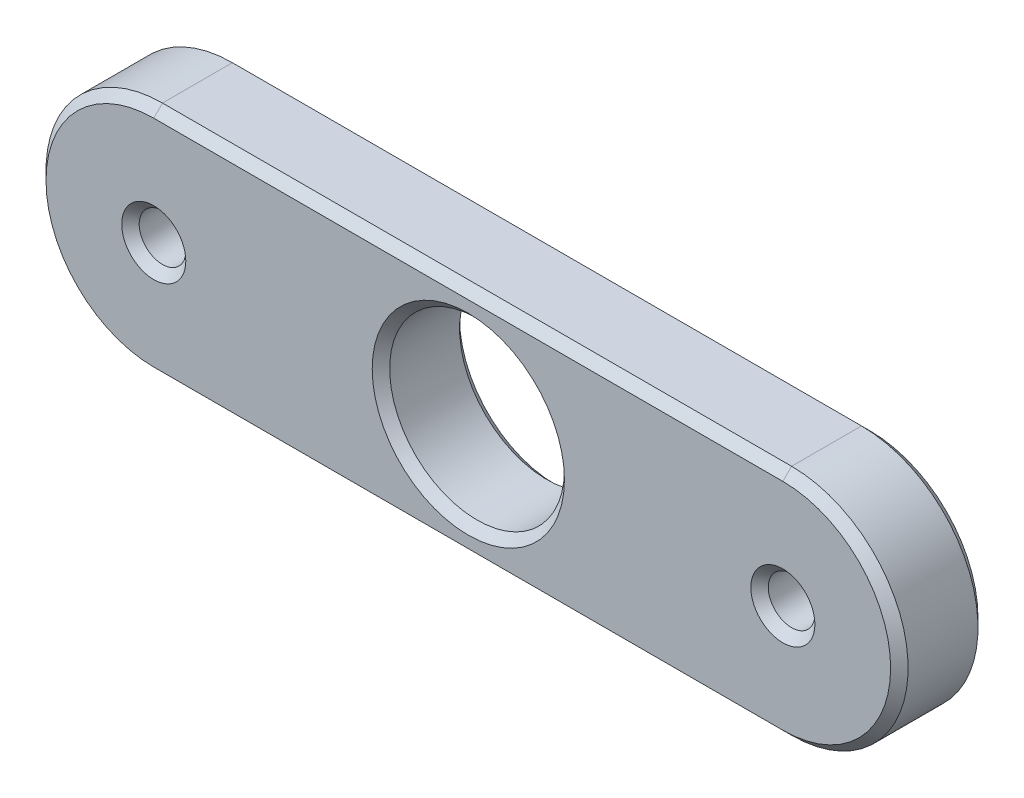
ISO-10303-21;
HEADER;
FILE_DESCRIPTION(('STEP AP214'),'2;1');
FILE_NAME('part.step','',(''),(''),'','','');
FILE_SCHEMA(('AUTOMOTIVE_DESIGN { 1 0 10303 214 1 1 1 1 }'));
ENDSEC;
DATA;
#1=APPLICATION_CONTEXT('core data for automotive mechanical design processes');
#2=APPLICATION_PROTOCOL_DEFINITION('international standard','automotive_design',2000,#1);
#3=PRODUCT_CONTEXT('',#1,'mechanical');
#4=PRODUCT('Part','Part','',(#3));
#5=PRODUCT_RELATED_PRODUCT_CATEGORY('part','',(#4));
#6=PRODUCT_DEFINITION_FORMATION('','',#4);
#7=PRODUCT_DEFINITION_CONTEXT('part definition',#1,'design');
#8=PRODUCT_DEFINITION('design','',#6,#7);
#9=PRODUCT_DEFINITION_SHAPE('','',#8);
#10=(LENGTH_UNIT() NAMED_UNIT(*) SI_UNIT(.MILLI.,.METRE.));
#11=(NAMED_UNIT(*) PLANE_ANGLE_UNIT() SI_UNIT($,.RADIAN.));
#12=(NAMED_UNIT(*) SI_UNIT($,.STERADIAN.) SOLID_ANGLE_UNIT());
#13=UNCERTAINTY_MEASURE_WITH_UNIT(LENGTH_MEASURE(1.E-05),#10,'distance_accuracy_value','');
#14=(GEOMETRIC_REPRESENTATION_CONTEXT(3) GLOBAL_UNCERTAINTY_ASSIGNED_CONTEXT((#13)) GLOBAL_UNIT_ASSIGNED_CONTEXT((#10,
#11,#12)) REPRESENTATION_CONTEXT('',''));
#15=CARTESIAN_POINT('',(0.,0.,0.));
#16=DIRECTION('',(0.,0.,1.));
#17=DIRECTION('',(1.,0.,0.));
#18=AXIS2_PLACEMENT_3D('',#15,#16,#17);
#19=CARTESIAN_POINT('',(27.,0.,7.5));
#20=DIRECTION('',(0.,0.,1.));
#21=DIRECTION('',(1.,0.,0.));
#22=AXIS2_PLACEMENT_3D('',#19,#20,#21);
#23=PLANE('',#22);
#24=CARTESIAN_POINT('',(0.,0.,7.5));
#25=DIRECTION('',(0.,0.,1.));
#26=DIRECTION('',(1.,0.,0.));
#27=AXIS2_PLACEMENT_3D('',#24,#25,#26);
#28=CIRCLE('',#27,8.24999999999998);
#29=CARTESIAN_POINT('',(8.24999999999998,0.,7.5));
#30=VERTEX_POINT('',#29);
#31=EDGE_CURVE('E11',#30,#30,#28,.F.);
#32=ORIENTED_EDGE('',*,*,#31,.T.);
#33=EDGE_LOOP('',(#32));
#34=FACE_BOUND('',#33,.T.);
#35=CARTESIAN_POINT('',(-27.,0.,7.5));
#36=DIRECTION('',(0.,0.,1.));
#37=DIRECTION('',(1.,0.,0.));
#38=AXIS2_PLACEMENT_3D('',#35,#36,#37);
#39=CIRCLE('',#38,2.75000000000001);
#40=CARTESIAN_POINT('',(-24.25,0.,7.5));
#41=VERTEX_POINT('',#40);
#42=EDGE_CURVE('E42',#41,#41,#39,.F.);
#43=ORIENTED_EDGE('',*,*,#42,.T.);
#44=EDGE_LOOP('',(#43));
#45=FACE_BOUND('',#44,.T.);
#46=CARTESIAN_POINT('',(-27.,0.,7.5));
#47=DIRECTION('',(0.,0.,1.));
#48=DIRECTION('',(1.,0.,0.));
#49=AXIS2_PLACEMENT_3D('',#46,#47,#48);
#50=CIRCLE('',#49,9.25000000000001);
#51=CARTESIAN_POINT('',(-27.,9.25,7.5));
#52=VERTEX_POINT('',#51);
#53=CARTESIAN_POINT('',(-27.,-9.25000000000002,7.5));
#54=VERTEX_POINT('',#53);
#55=EDGE_CURVE('E50',#52,#54,#50,.T.);
#56=ORIENTED_EDGE('',*,*,#55,.T.);
#57=DIRECTION('',(1.,0.,0.));
#58=VECTOR('',#57,1.);
#59=CARTESIAN_POINT('',(27.,-9.25,7.5));
#60=LINE('',#59,#58);
#61=CARTESIAN_POINT('',(27.,-9.25,7.5));
#62=VERTEX_POINT('',#61);
#63=EDGE_CURVE('E181',#54,#62,#60,.T.);
#64=ORIENTED_EDGE('',*,*,#63,.T.);
#65=CARTESIAN_POINT('',(27.,0.,7.5));
#66=DIRECTION('',(0.,0.,1.));
#67=DIRECTION('',(1.,0.,0.));
#68=AXIS2_PLACEMENT_3D('',#65,#66,#67);
#69=CIRCLE('',#68,9.25000000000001);
#70=CARTESIAN_POINT('',(27.,9.25000000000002,7.5));
#71=VERTEX_POINT('',#70);
#72=EDGE_CURVE('E177',#62,#71,#69,.T.);
#73=ORIENTED_EDGE('',*,*,#72,.T.);
#74=DIRECTION('',(-1.,0.,0.));
#75=VECTOR('',#74,1.);
#76=CARTESIAN_POINT('',(-27.,9.25,7.5));
#77=LINE('',#76,#75);
#78=EDGE_CURVE('E55',#71,#52,#77,.T.);
#79=ORIENTED_EDGE('',*,*,#78,.T.);
#80=EDGE_LOOP('',(#56,#64,#73,#79));
#81=FACE_BOUND('',#80,.T.);
#82=CARTESIAN_POINT('',(27.,0.,7.5));
#83=DIRECTION('',(0.,0.,1.));
#84=DIRECTION('',(1.,0.,0.));
#85=AXIS2_PLACEMENT_3D('',#82,#83,#84);
#86=CIRCLE('',#85,2.74999999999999);
#87=CARTESIAN_POINT('',(29.75,0.,7.5));
#88=VERTEX_POINT('',#87);
#89=EDGE_CURVE('E174',#88,#88,#86,.F.);
#90=ORIENTED_EDGE('',*,*,#89,.T.);
#91=EDGE_LOOP('',(#90));
#92=FACE_BOUND('',#91,.T.);
#93=ADVANCED_FACE('F33',(#34,#45,#81,#92),#23,.T.);
#94=CARTESIAN_POINT('',(27.,0.,0.));
#95=DIRECTION('',(0.,0.,1.));
#96=DIRECTION('',(1.,0.,0.));
#97=AXIS2_PLACEMENT_3D('',#94,#95,#96);
#98=PLANE('',#97);
#99=CARTESIAN_POINT('',(0.,0.,0.));
#100=DIRECTION('',(0.,0.,1.));
#101=DIRECTION('',(1.,0.,0.));
#102=AXIS2_PLACEMENT_3D('',#99,#100,#101);
#103=CIRCLE('',#102,8.24999999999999);
#104=CARTESIAN_POINT('',(8.24999999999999,0.,0.));
#105=VERTEX_POINT('',#104);
#106=EDGE_CURVE('E137',#105,#105,#103,.T.);
#107=ORIENTED_EDGE('',*,*,#106,.T.);
#108=EDGE_LOOP('',(#107));
#109=FACE_BOUND('',#108,.T.);
#110=CARTESIAN_POINT('',(27.,0.,0.));
#111=DIRECTION('',(0.,0.,1.));
#112=DIRECTION('',(1.,0.,0.));
#113=AXIS2_PLACEMENT_3D('',#110,#111,#112);
#114=CIRCLE('',#113,2.75);
#115=CARTESIAN_POINT('',(29.75,0.,0.));
#116=VERTEX_POINT('',#115);
#117=EDGE_CURVE('E130',#116,#116,#114,.T.);
#118=ORIENTED_EDGE('',*,*,#117,.T.);
#119=EDGE_LOOP('',(#118));
#120=FACE_BOUND('',#119,.T.);
#121=CARTESIAN_POINT('',(-27.,0.,0.));
#122=DIRECTION('',(0.,0.,1.));
#123=DIRECTION('',(1.,0.,0.));
#124=AXIS2_PLACEMENT_3D('',#121,#122,#123);
#125=CIRCLE('',#124,2.75);
#126=CARTESIAN_POINT('',(-24.25,0.,0.));
#127=VERTEX_POINT('',#126);
#128=EDGE_CURVE('E127',#127,#127,#125,.T.);
#129=ORIENTED_EDGE('',*,*,#128,.T.);
#130=EDGE_LOOP('',(#129));
#131=FACE_BOUND('',#130,.T.);
#132=CARTESIAN_POINT('',(-27.,0.,0.));
#133=DIRECTION('',(0.,0.,1.));
#134=DIRECTION('',(1.,0.,0.));
#135=AXIS2_PLACEMENT_3D('',#132,#133,#134);
#136=CIRCLE('',#135,9.24999999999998);
#137=CARTESIAN_POINT('',(-27.,-9.24999999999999,0.));
#138=VERTEX_POINT('',#137);
#139=CARTESIAN_POINT('',(-27.,9.24999999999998,0.));
#140=VERTEX_POINT('',#139);
#141=EDGE_CURVE('E126',#138,#140,#136,.F.);
#142=ORIENTED_EDGE('',*,*,#141,.T.);
#143=DIRECTION('',(1.,0.,0.));
#144=VECTOR('',#143,1.);
#145=CARTESIAN_POINT('',(27.,9.24999999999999,0.));
#146=LINE('',#145,#144);
#147=CARTESIAN_POINT('',(27.,9.24999999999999,0.));
#148=VERTEX_POINT('',#147);
#149=EDGE_CURVE('E105',#140,#148,#146,.T.);
#150=ORIENTED_EDGE('',*,*,#149,.T.);
#151=CARTESIAN_POINT('',(27.,0.,0.));
#152=DIRECTION('',(0.,0.,1.));
#153=DIRECTION('',(1.,0.,0.));
#154=AXIS2_PLACEMENT_3D('',#151,#152,#153);
#155=CIRCLE('',#154,9.24999999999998);
#156=CARTESIAN_POINT('',(27.,-9.24999999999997,0.));
#157=VERTEX_POINT('',#156);
#158=EDGE_CURVE('E115',#148,#157,#155,.F.);
#159=ORIENTED_EDGE('',*,*,#158,.T.);
#160=DIRECTION('',(-1.,0.,0.));
#161=VECTOR('',#160,1.);
#162=CARTESIAN_POINT('',(27.,-9.24999999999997,0.));
#163=LINE('',#162,#161);
#164=EDGE_CURVE('E121',#157,#138,#163,.T.);
#165=ORIENTED_EDGE('',*,*,#164,.T.);
#166=EDGE_LOOP('',(#142,#150,#159,#165));
#167=FACE_BOUND('',#166,.T.);
#168=ADVANCED_FACE('F124',(#109,#120,#131,#167),#98,.F.);
#169=CARTESIAN_POINT('',(27.,0.,7.5));
#170=DIRECTION('',(0.,0.,-1.));
#171=DIRECTION('',(-1.,0.,0.));
#172=AXIS2_PLACEMENT_3D('',#169,#170,#171);
#173=CYLINDRICAL_SURFACE('',#172,10.);
#174=DIRECTION('',(0.,0.,-1.));
#175=VECTOR('',#174,1.);
#176=CARTESIAN_POINT('',(27.,-9.99999999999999,7.5));
#177=LINE('',#176,#175);
#178=CARTESIAN_POINT('',(27.,-9.99999999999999,6.75000000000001));
#179=VERTEX_POINT('',#178);
#180=CARTESIAN_POINT('',(27.,-9.99999999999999,0.750000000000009));
#181=VERTEX_POINT('',#180);
#182=EDGE_CURVE('E189',#179,#181,#177,.T.);
#183=ORIENTED_EDGE('',*,*,#182,.T.);
#184=CARTESIAN_POINT('',(27.,0.,0.750000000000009));
#185=DIRECTION('',(0.,0.,1.));
#186=DIRECTION('',(1.,0.,0.));
#187=AXIS2_PLACEMENT_3D('',#184,#185,#186);
#188=CIRCLE('',#187,10.);
#189=CARTESIAN_POINT('',(27.,10.,0.750000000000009));
#190=VERTEX_POINT('',#189);
#191=EDGE_CURVE('E172',#181,#190,#188,.T.);
#192=ORIENTED_EDGE('',*,*,#191,.T.);
#193=DIRECTION('',(0.,0.,-1.));
#194=VECTOR('',#193,1.);
#195=CARTESIAN_POINT('',(27.,10.,7.5));
#196=LINE('',#195,#194);
#197=CARTESIAN_POINT('',(27.,10.,6.75000000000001));
#198=VERTEX_POINT('',#197);
#199=EDGE_CURVE('E122',#198,#190,#196,.T.);
#200=ORIENTED_EDGE('',*,*,#199,.F.);
#201=CARTESIAN_POINT('',(27.,0.,6.75000000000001));
#202=DIRECTION('',(0.,0.,1.));
#203=DIRECTION('',(1.,0.,0.));
#204=AXIS2_PLACEMENT_3D('',#201,#202,#203);
#205=CIRCLE('',#204,10.);
#206=EDGE_CURVE('E170',#198,#179,#205,.F.);
#207=ORIENTED_EDGE('',*,*,#206,.T.);
#208=EDGE_LOOP('',(#183,#192,#200,#207));
#209=FACE_BOUND('',#208,.T.);
#210=ADVANCED_FACE('F215',(#209),#173,.T.);
#211=CARTESIAN_POINT('',(27.,10.,7.5));
#212=DIRECTION('',(0.,-1.,0.));
#213=DIRECTION('',(1.,0.,0.));
#214=AXIS2_PLACEMENT_3D('',#211,#212,#213);
#215=PLANE('',#214);
#216=ORIENTED_EDGE('',*,*,#199,.T.);
#217=DIRECTION('',(-1.,0.,0.));
#218=VECTOR('',#217,1.);
#219=CARTESIAN_POINT('',(27.,10.,0.750000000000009));
#220=LINE('',#219,#218);
#221=CARTESIAN_POINT('',(-27.,9.99999999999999,0.750000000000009));
#222=VERTEX_POINT('',#221);
#223=EDGE_CURVE('E108',#190,#222,#220,.T.);
#224=ORIENTED_EDGE('',*,*,#223,.T.);
#225=DIRECTION('',(0.,0.,-1.));
#226=VECTOR('',#225,1.);
#227=CARTESIAN_POINT('',(-27.,9.99999999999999,7.5));
#228=LINE('',#227,#226);
#229=CARTESIAN_POINT('',(-27.,9.99999999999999,6.75000000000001));
#230=VERTEX_POINT('',#229);
#231=EDGE_CURVE('E212',#230,#222,#228,.T.);
#232=ORIENTED_EDGE('',*,*,#231,.F.);
#233=DIRECTION('',(1.,0.,0.));
#234=VECTOR('',#233,1.);
#235=CARTESIAN_POINT('',(27.,10.,6.75000000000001));
#236=LINE('',#235,#234);
#237=EDGE_CURVE('E158',#230,#198,#236,.T.);
#238=ORIENTED_EDGE('',*,*,#237,.T.);
#239=EDGE_LOOP('',(#216,#224,#232,#238));
#240=FACE_BOUND('',#239,.T.);
#241=ADVANCED_FACE('F210',(#240),#215,.F.);
#242=CARTESIAN_POINT('',(-27.,0.,7.5));
#243=DIRECTION('',(0.,0.,-1.));
#244=DIRECTION('',(-1.,0.,0.));
#245=AXIS2_PLACEMENT_3D('',#242,#243,#244);
#246=CYLINDRICAL_SURFACE('',#245,10.);
#247=ORIENTED_EDGE('',*,*,#231,.T.);
#248=CARTESIAN_POINT('',(-27.,0.,0.750000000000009));
#249=DIRECTION('',(0.,0.,1.));
#250=DIRECTION('',(1.,0.,0.));
#251=AXIS2_PLACEMENT_3D('',#248,#249,#250);
#252=CIRCLE('',#251,10.);
#253=CARTESIAN_POINT('',(-27.,-10.,0.750000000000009));
#254=VERTEX_POINT('',#253);
#255=EDGE_CURVE('E163',#222,#254,#252,.T.);
#256=ORIENTED_EDGE('',*,*,#255,.T.);
#257=DIRECTION('',(0.,0.,-1.));
#258=VECTOR('',#257,1.);
#259=CARTESIAN_POINT('',(-27.,-10.,7.5));
#260=LINE('',#259,#258);
#261=CARTESIAN_POINT('',(-27.,-10.,6.75000000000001));
#262=VERTEX_POINT('',#261);
#263=EDGE_CURVE('E218',#262,#254,#260,.T.);
#264=ORIENTED_EDGE('',*,*,#263,.F.);
#265=CARTESIAN_POINT('',(-27.,0.,6.75000000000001));
#266=DIRECTION('',(0.,0.,1.));
#267=DIRECTION('',(1.,0.,0.));
#268=AXIS2_PLACEMENT_3D('',#265,#266,#267);
#269=CIRCLE('',#268,10.);
#270=EDGE_CURVE('E161',#262,#230,#269,.F.);
#271=ORIENTED_EDGE('',*,*,#270,.T.);
#272=EDGE_LOOP('',(#247,#256,#264,#271));
#273=FACE_BOUND('',#272,.T.);
#274=ADVANCED_FACE('F231',(#273),#246,.T.);
#275=CARTESIAN_POINT('',(27.,-9.99999999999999,7.5));
#276=DIRECTION('',(0.,1.,0.));
#277=DIRECTION('',(-1.,0.,0.));
#278=AXIS2_PLACEMENT_3D('',#275,#276,#277);
#279=PLANE('',#278);
#280=ORIENTED_EDGE('',*,*,#263,.T.);
#281=DIRECTION('',(1.,0.,0.));
#282=VECTOR('',#281,1.);
#283=CARTESIAN_POINT('',(27.,-9.99999999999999,0.750000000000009));
#284=LINE('',#283,#282);
#285=EDGE_CURVE('E168',#254,#181,#284,.T.);
#286=ORIENTED_EDGE('',*,*,#285,.T.);
#287=ORIENTED_EDGE('',*,*,#182,.F.);
#288=DIRECTION('',(-1.,0.,0.));
#289=VECTOR('',#288,1.);
#290=CARTESIAN_POINT('',(-27.,-10.,6.75000000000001));
#291=LINE('',#290,#289);
#292=EDGE_CURVE('E165',#179,#262,#291,.T.);
#293=ORIENTED_EDGE('',*,*,#292,.T.);
#294=EDGE_LOOP('',(#280,#286,#287,#293));
#295=FACE_BOUND('',#294,.T.);
#296=ADVANCED_FACE('F235',(#295),#279,.F.);
#297=CARTESIAN_POINT('',(-27.,0.,7.5));
#298=DIRECTION('',(0.,0.,-1.));
#299=DIRECTION('',(-1.,0.,0.));
#300=AXIS2_PLACEMENT_3D('',#297,#298,#299);
#301=CYLINDRICAL_SURFACE('',#300,2.);
#302=CARTESIAN_POINT('',(-27.,0.,0.749999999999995));
#303=DIRECTION('',(0.,0.,1.));
#304=DIRECTION('',(1.,0.,0.));
#305=AXIS2_PLACEMENT_3D('',#302,#303,#304);
#306=CIRCLE('',#305,2.);
#307=CARTESIAN_POINT('',(-25.,0.,0.749999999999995));
#308=VERTEX_POINT('',#307);
#309=EDGE_CURVE('E155',#308,#308,#306,.F.);
#310=ORIENTED_EDGE('',*,*,#309,.T.);
#311=EDGE_LOOP('',(#310));
#312=FACE_BOUND('',#311,.T.);
#313=CARTESIAN_POINT('',(-27.,0.,6.75));
#314=DIRECTION('',(0.,0.,1.));
#315=DIRECTION('',(1.,0.,0.));
#316=AXIS2_PLACEMENT_3D('',#313,#314,#315);
#317=CIRCLE('',#316,2.);
#318=CARTESIAN_POINT('',(-25.,0.,6.75));
#319=VERTEX_POINT('',#318);
#320=EDGE_CURVE('E152',#319,#319,#317,.T.);
#321=ORIENTED_EDGE('',*,*,#320,.T.);
#322=EDGE_LOOP('',(#321));
#323=FACE_BOUND('',#322,.T.);
#324=ADVANCED_FACE('F254',(#312,#323),#301,.F.);
#325=CARTESIAN_POINT('',(27.,0.,7.5));
#326=DIRECTION('',(0.,0.,-1.));
#327=DIRECTION('',(-1.,0.,0.));
#328=AXIS2_PLACEMENT_3D('',#325,#326,#327);
#329=CYLINDRICAL_SURFACE('',#328,2.);
#330=CARTESIAN_POINT('',(27.,0.,0.749999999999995));
#331=DIRECTION('',(0.,0.,1.));
#332=DIRECTION('',(1.,0.,0.));
#333=AXIS2_PLACEMENT_3D('',#330,#331,#332);
#334=CIRCLE('',#333,2.);
#335=CARTESIAN_POINT('',(29.,0.,0.749999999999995));
#336=VERTEX_POINT('',#335);
#337=EDGE_CURVE('E149',#336,#336,#334,.F.);
#338=ORIENTED_EDGE('',*,*,#337,.T.);
#339=EDGE_LOOP('',(#338));
#340=FACE_BOUND('',#339,.T.);
#341=CARTESIAN_POINT('',(27.,0.,6.75000000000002));
#342=DIRECTION('',(0.,0.,1.));
#343=DIRECTION('',(1.,0.,0.));
#344=AXIS2_PLACEMENT_3D('',#341,#342,#343);
#345=CIRCLE('',#344,2.);
#346=CARTESIAN_POINT('',(29.,0.,6.75000000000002));
#347=VERTEX_POINT('',#346);
#348=EDGE_CURVE('E146',#347,#347,#345,.T.);
#349=ORIENTED_EDGE('',*,*,#348,.T.);
#350=EDGE_LOOP('',(#349));
#351=FACE_BOUND('',#350,.T.);
#352=ADVANCED_FACE('F251',(#340,#351),#329,.F.);
#353=CARTESIAN_POINT('',(0.,0.,7.5));
#354=DIRECTION('',(0.,0.,-1.));
#355=DIRECTION('',(-1.,0.,0.));
#356=AXIS2_PLACEMENT_3D('',#353,#354,#355);
#357=CYLINDRICAL_SURFACE('',#356,7.5);
#358=CARTESIAN_POINT('',(0.,0.,0.749999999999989));
#359=DIRECTION('',(0.,0.,1.));
#360=DIRECTION('',(1.,0.,0.));
#361=AXIS2_PLACEMENT_3D('',#358,#359,#360);
#362=CIRCLE('',#361,7.5);
#363=CARTESIAN_POINT('',(7.5,0.,0.749999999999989));
#364=VERTEX_POINT('',#363);
#365=EDGE_CURVE('E143',#364,#364,#362,.F.);
#366=ORIENTED_EDGE('',*,*,#365,.T.);
#367=EDGE_LOOP('',(#366));
#368=FACE_BOUND('',#367,.T.);
#369=CARTESIAN_POINT('',(0.,0.,6.75000000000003));
#370=DIRECTION('',(0.,0.,1.));
#371=DIRECTION('',(1.,0.,0.));
#372=AXIS2_PLACEMENT_3D('',#369,#370,#371);
#373=CIRCLE('',#372,7.5);
#374=CARTESIAN_POINT('',(7.5,0.,6.75000000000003));
#375=VERTEX_POINT('',#374);
#376=EDGE_CURVE('E140',#375,#375,#373,.T.);
#377=ORIENTED_EDGE('',*,*,#376,.T.);
#378=EDGE_LOOP('',(#377));
#379=FACE_BOUND('',#378,.T.);
#380=ADVANCED_FACE('F253',(#368,#379),#357,.F.);
#381=CARTESIAN_POINT('',(0.,0.,0.));
#382=DIRECTION('',(0.,0.,-1.));
#383=DIRECTION('',(-1.,0.,0.));
#384=AXIS2_PLACEMENT_3D('',#381,#382,#383);
#385=CONICAL_SURFACE('',#384,8.24999999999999,0.785398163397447);
#386=ORIENTED_EDGE('',*,*,#365,.F.);
#387=EDGE_LOOP('',(#386));
#388=FACE_BOUND('',#387,.T.);
#389=ORIENTED_EDGE('',*,*,#106,.F.);
#390=EDGE_LOOP('',(#389));
#391=FACE_BOUND('',#390,.T.);
#392=ADVANCED_FACE('F261',(#388,#391),#385,.F.);
#393=CARTESIAN_POINT('',(27.,0.,0.));
#394=DIRECTION('',(0.,0.,-1.));
#395=DIRECTION('',(-1.,0.,0.));
#396=AXIS2_PLACEMENT_3D('',#393,#394,#395);
#397=CONICAL_SURFACE('',#396,2.75,0.785398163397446);
#398=ORIENTED_EDGE('',*,*,#337,.F.);
#399=EDGE_LOOP('',(#398));
#400=FACE_BOUND('',#399,.T.);
#401=ORIENTED_EDGE('',*,*,#117,.F.);
#402=EDGE_LOOP('',(#401));
#403=FACE_BOUND('',#402,.T.);
#404=ADVANCED_FACE('F280',(#400,#403),#397,.F.);
#405=CARTESIAN_POINT('',(-27.,0.,0.));
#406=DIRECTION('',(0.,0.,-1.));
#407=DIRECTION('',(-1.,0.,0.));
#408=AXIS2_PLACEMENT_3D('',#405,#406,#407);
#409=CONICAL_SURFACE('',#408,2.75,0.785398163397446);
#410=ORIENTED_EDGE('',*,*,#309,.F.);
#411=EDGE_LOOP('',(#410));
#412=FACE_BOUND('',#411,.T.);
#413=ORIENTED_EDGE('',*,*,#128,.F.);
#414=EDGE_LOOP('',(#413));
#415=FACE_BOUND('',#414,.T.);
#416=ADVANCED_FACE('F284',(#412,#415),#409,.F.);
#417=CARTESIAN_POINT('',(27.,-9.99999999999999,0.750000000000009));
#418=DIRECTION('',(0.,0.707106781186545,0.70710678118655));
#419=DIRECTION('',(1.,0.,0.));
#420=AXIS2_PLACEMENT_3D('',#417,#418,#419);
#421=PLANE('',#420);
#422=DIRECTION('',(0.,-0.70710678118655,0.707106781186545));
#423=VECTOR('',#422,1.);
#424=CARTESIAN_POINT('',(-27.,-9.24999999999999,0.));
#425=LINE('',#424,#423);
#426=EDGE_CURVE('E111',#138,#254,#425,.T.);
#427=ORIENTED_EDGE('',*,*,#426,.F.);
#428=ORIENTED_EDGE('',*,*,#164,.F.);
#429=DIRECTION('',(0.,0.70710678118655,-0.707106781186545));
#430=VECTOR('',#429,1.);
#431=CARTESIAN_POINT('',(27.,-9.99999999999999,0.750000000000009));
#432=LINE('',#431,#430);
#433=EDGE_CURVE('E118',#181,#157,#432,.T.);
#434=ORIENTED_EDGE('',*,*,#433,.F.);
#435=ORIENTED_EDGE('',*,*,#285,.F.);
#436=EDGE_LOOP('',(#427,#428,#434,#435));
#437=FACE_BOUND('',#436,.T.);
#438=ADVANCED_FACE('F224',(#437),#421,.F.);
#439=CARTESIAN_POINT('',(27.,0.,0.750000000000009));
#440=DIRECTION('',(0.,0.,1.));
#441=DIRECTION('',(1.,0.,0.));
#442=AXIS2_PLACEMENT_3D('',#439,#440,#441);
#443=CONICAL_SURFACE('',#442,10.,0.785398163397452);
#444=ORIENTED_EDGE('',*,*,#433,.T.);
#445=ORIENTED_EDGE('',*,*,#158,.F.);
#446=DIRECTION('',(0.,-0.70710678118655,-0.707106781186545));
#447=VECTOR('',#446,1.);
#448=CARTESIAN_POINT('',(27.,10.,0.750000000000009));
#449=LINE('',#448,#447);
#450=EDGE_CURVE('E101',#190,#148,#449,.T.);
#451=ORIENTED_EDGE('',*,*,#450,.F.);
#452=ORIENTED_EDGE('',*,*,#191,.F.);
#453=EDGE_LOOP('',(#444,#445,#451,#452));
#454=FACE_BOUND('',#453,.T.);
#455=ADVANCED_FACE('F116',(#454),#443,.T.);
#456=CARTESIAN_POINT('',(-27.,0.,0.750000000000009));
#457=DIRECTION('',(0.,0.,1.));
#458=DIRECTION('',(1.,0.,0.));
#459=AXIS2_PLACEMENT_3D('',#456,#457,#458);
#460=CONICAL_SURFACE('',#459,10.,0.785398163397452);
#461=ORIENTED_EDGE('',*,*,#426,.T.);
#462=ORIENTED_EDGE('',*,*,#255,.F.);
#463=DIRECTION('',(0.,0.70710678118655,0.707106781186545));
#464=VECTOR('',#463,1.);
#465=CARTESIAN_POINT('',(-27.,9.24999999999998,0.));
#466=LINE('',#465,#464);
#467=EDGE_CURVE('E112',#140,#222,#466,.T.);
#468=ORIENTED_EDGE('',*,*,#467,.F.);
#469=ORIENTED_EDGE('',*,*,#141,.F.);
#470=EDGE_LOOP('',(#461,#462,#468,#469));
#471=FACE_BOUND('',#470,.T.);
#472=ADVANCED_FACE('F227',(#471),#460,.T.);
#473=CARTESIAN_POINT('',(27.,10.,0.750000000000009));
#474=DIRECTION('',(0.,-0.707106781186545,0.70710678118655));
#475=DIRECTION('',(-1.,0.,0.));
#476=AXIS2_PLACEMENT_3D('',#473,#474,#475);
#477=PLANE('',#476);
#478=ORIENTED_EDGE('',*,*,#450,.T.);
#479=ORIENTED_EDGE('',*,*,#149,.F.);
#480=ORIENTED_EDGE('',*,*,#467,.T.);
#481=ORIENTED_EDGE('',*,*,#223,.F.);
#482=EDGE_LOOP('',(#478,#479,#480,#481));
#483=FACE_BOUND('',#482,.T.);
#484=ADVANCED_FACE('F103',(#483),#477,.F.);
#485=CARTESIAN_POINT('',(0.,0.,6.75000000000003));
#486=DIRECTION('',(0.,0.,1.));
#487=DIRECTION('',(1.,0.,0.));
#488=AXIS2_PLACEMENT_3D('',#485,#486,#487);
#489=CONICAL_SURFACE('',#488,7.5,0.785398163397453);
#490=ORIENTED_EDGE('',*,*,#31,.F.);
#491=EDGE_LOOP('',(#490));
#492=FACE_BOUND('',#491,.T.);
#493=ORIENTED_EDGE('',*,*,#376,.F.);
#494=EDGE_LOOP('',(#493));
#495=FACE_BOUND('',#494,.T.);
#496=ADVANCED_FACE('F291',(#492,#495),#489,.F.);
#497=CARTESIAN_POINT('',(-27.,0.,6.75));
#498=DIRECTION('',(0.,0.,1.));
#499=DIRECTION('',(1.,0.,0.));
#500=AXIS2_PLACEMENT_3D('',#497,#498,#499);
#501=CONICAL_SURFACE('',#500,2.,0.785398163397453);
#502=ORIENTED_EDGE('',*,*,#42,.F.);
#503=EDGE_LOOP('',(#502));
#504=FACE_BOUND('',#503,.T.);
#505=ORIENTED_EDGE('',*,*,#320,.F.);
#506=EDGE_LOOP('',(#505));
#507=FACE_BOUND('',#506,.T.);
#508=ADVANCED_FACE('F300',(#504,#507),#501,.F.);
#509=CARTESIAN_POINT('',(27.,9.25000000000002,7.5));
#510=DIRECTION('',(0.,0.707106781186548,0.707106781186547));
#511=DIRECTION('',(1.,0.,0.));
#512=AXIS2_PLACEMENT_3D('',#509,#510,#511);
#513=PLANE('',#512);
#514=DIRECTION('',(0.,-0.707106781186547,0.707106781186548));
#515=VECTOR('',#514,1.);
#516=CARTESIAN_POINT('',(27.,10.,6.75000000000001));
#517=LINE('',#516,#515);
#518=EDGE_CURVE('E193',#198,#71,#517,.T.);
#519=ORIENTED_EDGE('',*,*,#518,.F.);
#520=ORIENTED_EDGE('',*,*,#237,.F.);
#521=DIRECTION('',(0.,0.707106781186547,-0.707106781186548));
#522=VECTOR('',#521,1.);
#523=CARTESIAN_POINT('',(-27.,9.25,7.5));
#524=LINE('',#523,#522);
#525=EDGE_CURVE('E37',#52,#230,#524,.T.);
#526=ORIENTED_EDGE('',*,*,#525,.F.);
#527=ORIENTED_EDGE('',*,*,#78,.F.);
#528=EDGE_LOOP('',(#519,#520,#526,#527));
#529=FACE_BOUND('',#528,.T.);
#530=ADVANCED_FACE('F205',(#529),#513,.T.);
#531=CARTESIAN_POINT('',(-27.,0.,7.5));
#532=DIRECTION('',(0.,0.,-1.));
#533=DIRECTION('',(-1.,0.,0.));
#534=AXIS2_PLACEMENT_3D('',#531,#532,#533);
#535=CONICAL_SURFACE('',#534,9.25000000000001,0.785398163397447);
#536=ORIENTED_EDGE('',*,*,#525,.T.);
#537=ORIENTED_EDGE('',*,*,#270,.F.);
#538=DIRECTION('',(0.,-0.707106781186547,-0.707106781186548));
#539=VECTOR('',#538,1.);
#540=CARTESIAN_POINT('',(-27.,-9.25000000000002,7.5));
#541=LINE('',#540,#539);
#542=EDGE_CURVE('E192',#54,#262,#541,.T.);
#543=ORIENTED_EDGE('',*,*,#542,.F.);
#544=ORIENTED_EDGE('',*,*,#55,.F.);
#545=EDGE_LOOP('',(#536,#537,#543,#544));
#546=FACE_BOUND('',#545,.T.);
#547=ADVANCED_FACE('F202',(#546),#535,.T.);
#548=CARTESIAN_POINT('',(27.,0.,7.5));
#549=DIRECTION('',(0.,0.,-1.));
#550=DIRECTION('',(-1.,0.,0.));
#551=AXIS2_PLACEMENT_3D('',#548,#549,#550);
#552=CONICAL_SURFACE('',#551,9.25000000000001,0.785398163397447);
#553=ORIENTED_EDGE('',*,*,#518,.T.);
#554=ORIENTED_EDGE('',*,*,#72,.F.);
#555=DIRECTION('',(0.,0.707106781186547,0.707106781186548));
#556=VECTOR('',#555,1.);
#557=CARTESIAN_POINT('',(27.,-9.99999999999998,6.75000000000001));
#558=LINE('',#557,#556);
#559=EDGE_CURVE('E190',#179,#62,#558,.T.);
#560=ORIENTED_EDGE('',*,*,#559,.F.);
#561=ORIENTED_EDGE('',*,*,#206,.F.);
#562=EDGE_LOOP('',(#553,#554,#560,#561));
#563=FACE_BOUND('',#562,.T.);
#564=ADVANCED_FACE('F240',(#563),#552,.T.);
#565=CARTESIAN_POINT('',(27.,-9.25,7.5));
#566=DIRECTION('',(0.,-0.707106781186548,0.707106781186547));
#567=DIRECTION('',(-1.,0.,0.));
#568=AXIS2_PLACEMENT_3D('',#565,#566,#567);
#569=PLANE('',#568);
#570=ORIENTED_EDGE('',*,*,#542,.T.);
#571=ORIENTED_EDGE('',*,*,#292,.F.);
#572=ORIENTED_EDGE('',*,*,#559,.T.);
#573=ORIENTED_EDGE('',*,*,#63,.F.);
#574=EDGE_LOOP('',(#570,#571,#572,#573));
#575=FACE_BOUND('',#574,.T.);
#576=ADVANCED_FACE('F238',(#575),#569,.T.);
#577=CARTESIAN_POINT('',(27.,0.,6.75000000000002));
#578=DIRECTION('',(0.,0.,1.));
#579=DIRECTION('',(1.,0.,0.));
#580=AXIS2_PLACEMENT_3D('',#577,#578,#579);
#581=CONICAL_SURFACE('',#580,2.,0.785398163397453);
#582=CARTESIAN_POINT('',(29.75,0.,7.5));
#583=CARTESIAN_POINT('',(29.7421875,0.,7.4921875));
#584=CARTESIAN_POINT('',(29.734375,0.,7.484375));
#585=CARTESIAN_POINT('',(29.71875,0.,7.46875));
#586=CARTESIAN_POINT('',(29.7109375,0.,7.4609375));
#587=CARTESIAN_POINT('',(29.6953125,0.,7.4453125));
#588=CARTESIAN_POINT('',(29.6875,0.,7.4375));
#589=CARTESIAN_POINT('',(29.671875,0.,7.421875));
#590=CARTESIAN_POINT('',(29.6640625,0.,7.4140625));
#591=CARTESIAN_POINT('',(29.6484375,0.,7.3984375));
#592=CARTESIAN_POINT('',(29.640625,0.,7.390625));
#593=CARTESIAN_POINT('',(29.625,0.,7.375));
#594=CARTESIAN_POINT('',(29.6171875,0.,7.3671875));
#595=CARTESIAN_POINT('',(29.6015625,0.,7.3515625));
#596=CARTESIAN_POINT('',(29.59375,0.,7.34375));
#597=CARTESIAN_POINT('',(29.578125,0.,7.328125));
#598=CARTESIAN_POINT('',(29.5703125,0.,7.3203125));
#599=CARTESIAN_POINT('',(29.5546875,0.,7.30468750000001));
#600=CARTESIAN_POINT('',(29.546875,0.,7.29687500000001));
#601=CARTESIAN_POINT('',(29.53125,0.,7.28125000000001));
#602=CARTESIAN_POINT('',(29.5234375,0.,7.27343750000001));
#603=CARTESIAN_POINT('',(29.5078125,0.,7.25781250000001));
#604=CARTESIAN_POINT('',(29.5,0.,7.25000000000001));
#605=CARTESIAN_POINT('',(29.484375,0.,7.23437500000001));
#606=CARTESIAN_POINT('',(29.4765625,0.,7.22656250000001));
#607=CARTESIAN_POINT('',(29.4609375,0.,7.21093750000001));
#608=CARTESIAN_POINT('',(29.453125,0.,7.20312500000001));
#609=CARTESIAN_POINT('',(29.4375,0.,7.18750000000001));
#610=CARTESIAN_POINT('',(29.4296875,0.,7.17968750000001));
#611=CARTESIAN_POINT('',(29.4140625,0.,7.16406250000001));
#612=CARTESIAN_POINT('',(29.40625,0.,7.15625000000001));
#613=CARTESIAN_POINT('',(29.390625,0.,7.14062500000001));
#614=CARTESIAN_POINT('',(29.3828125,0.,7.13281250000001));
#615=CARTESIAN_POINT('',(29.3671875,0.,7.11718750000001));
#616=CARTESIAN_POINT('',(29.359375,0.,7.10937500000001));
#617=CARTESIAN_POINT('',(29.34375,0.,7.09375000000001));
#618=CARTESIAN_POINT('',(29.3359375,0.,7.08593750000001));
#619=CARTESIAN_POINT('',(29.3203125,0.,7.07031250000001));
#620=CARTESIAN_POINT('',(29.3125,0.,7.06250000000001));
#621=CARTESIAN_POINT('',(29.296875,0.,7.04687500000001));
#622=CARTESIAN_POINT('',(29.2890625,0.,7.03906250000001));
#623=CARTESIAN_POINT('',(29.2734375,0.,7.02343750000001));
#624=CARTESIAN_POINT('',(29.265625,0.,7.01562500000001));
#625=CARTESIAN_POINT('',(29.25,0.,7.00000000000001));
#626=CARTESIAN_POINT('',(29.2421875,0.,6.99218750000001));
#627=CARTESIAN_POINT('',(29.2265625,0.,6.97656250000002));
#628=CARTESIAN_POINT('',(29.21875,0.,6.96875000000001));
#629=CARTESIAN_POINT('',(29.203125,0.,6.95312500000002));
#630=CARTESIAN_POINT('',(29.1953125,0.,6.94531250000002));
#631=CARTESIAN_POINT('',(29.1796875,0.,6.92968750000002));
#632=CARTESIAN_POINT('',(29.171875,0.,6.92187500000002));
#633=CARTESIAN_POINT('',(29.15625,0.,6.90625000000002));
#634=CARTESIAN_POINT('',(29.1484375,0.,6.89843750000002));
#635=CARTESIAN_POINT('',(29.1328125,0.,6.88281250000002));
#636=CARTESIAN_POINT('',(29.125,0.,6.87500000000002));
#637=CARTESIAN_POINT('',(29.109375,0.,6.85937500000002));
#638=CARTESIAN_POINT('',(29.1015625,0.,6.85156250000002));
#639=CARTESIAN_POINT('',(29.0859375,0.,6.83593750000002));
#640=CARTESIAN_POINT('',(29.078125,0.,6.82812500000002));
#641=CARTESIAN_POINT('',(29.0625,0.,6.81250000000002));
#642=CARTESIAN_POINT('',(29.0546875,0.,6.80468750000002));
#643=CARTESIAN_POINT('',(29.0390625,0.,6.78906250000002));
#644=CARTESIAN_POINT('',(29.03125,0.,6.78125000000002));
#645=CARTESIAN_POINT('',(29.015625,0.,6.76562500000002));
#646=CARTESIAN_POINT('',(29.0078125,0.,6.75781250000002));
#647=CARTESIAN_POINT('',(29.,0.,6.75000000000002));
#648=B_SPLINE_CURVE_WITH_KNOTS('',3,(#582,#583,#584,#585,#586,#587,#588,#589,#590,#591,#592,
#593,#594,#595,#596,#597,#598,#599,#600,#601,#602,#603,#604,#605,#606,#607,#608,#609,#610,#611,
#612,#613,#614,#615,#616,#617,#618,#619,#620,#621,#622,#623,#624,#625,#626,#627,#628,#629,#630,
#631,#632,#633,#634,#635,#636,#637,#638,#639,#640,#641,#642,#643,#644,#645,#646,#647),
.UNSPECIFIED.,.F.,.F.,(4,2,2,2,2,2,2,2,2,2,2,2,2,2,2,2,2,2,2,2,2,2,2,2,2,2,2,2,2,2,2,2,4),(0.,
0.0331456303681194,0.0662912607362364,0.0994368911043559,0.132582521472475,0.165728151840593,
0.198873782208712,0.232019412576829,0.265165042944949,0.298310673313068,0.331456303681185,
0.364601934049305,0.397747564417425,0.430893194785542,0.464038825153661,0.497184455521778,
0.530330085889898,0.563475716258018,0.596621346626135,0.629766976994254,0.662912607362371,
0.696058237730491,0.729203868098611,0.762349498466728,0.795495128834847,0.828640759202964,
0.861786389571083,0.894932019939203,0.92807765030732,0.96122328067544,0.994368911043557,
1.02751454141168,1.0606601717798),.UNSPECIFIED.);
#649=EDGE_CURVE('BSEAM35',#88,#347,#648,.T.);
#650=ORIENTED_EDGE('',*,*,#89,.F.);
#651=ORIENTED_EDGE('',*,*,#348,.F.);
#652=ORIENTED_EDGE('',*,*,#649,.T.);
#653=ORIENTED_EDGE('',*,*,#649,.F.);
#654=EDGE_LOOP('',(#650,#652,#651,#653));
#655=FACE_BOUND('',#654,.T.);
#656=ADVANCED_FACE('F35',(#655),#581,.F.);
#657=CLOSED_SHELL('',(#93,#168,#210,#241,#274,#296,#324,#352,#380,#392,#404,#416,#438,#455,#472,
#484,#496,#508,#530,#547,#564,#576,#656));
#658=MANIFOLD_SOLID_BREP('B2',#657);
#659=ADVANCED_BREP_SHAPE_REPRESENTATION('',(#18,#658),#14);
#660=SHAPE_DEFINITION_REPRESENTATION(#9,#659);
ENDSEC;
END-ISO-10303-21;
